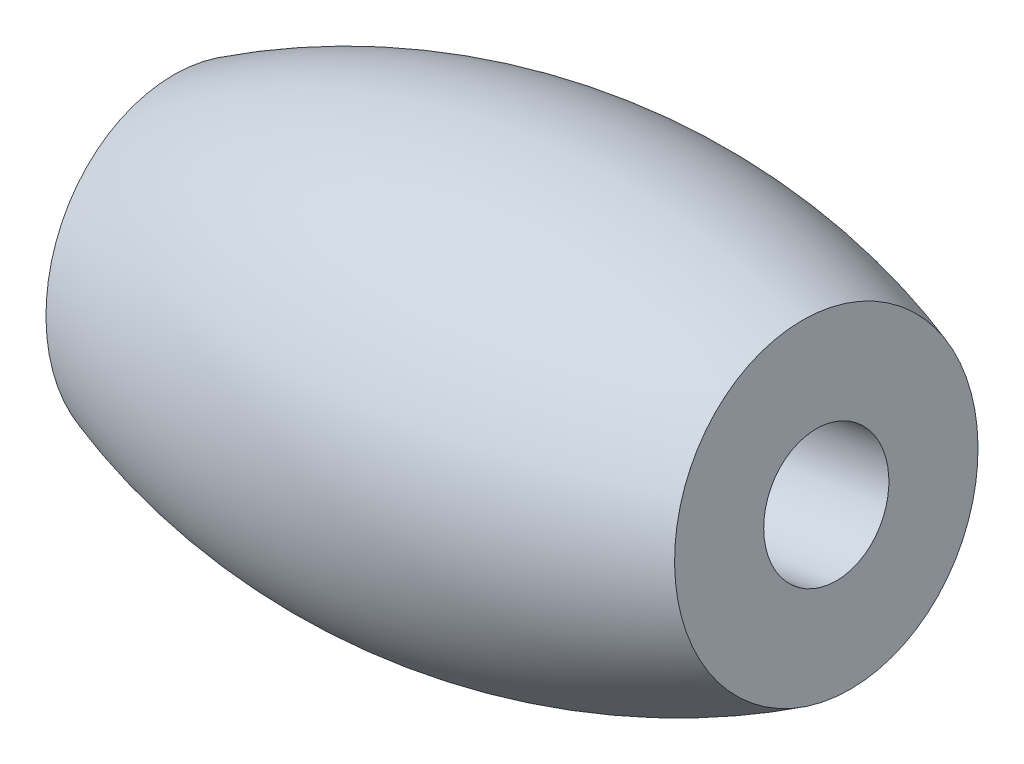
ISO-10303-21;
HEADER;
FILE_DESCRIPTION(('STEP AP214'),'2;1');
FILE_NAME('part.step','',(''),(''),'','','');
FILE_SCHEMA(('AUTOMOTIVE_DESIGN { 1 0 10303 214 1 1 1 1 }'));
ENDSEC;
DATA;
#1=APPLICATION_CONTEXT('core data for automotive mechanical design processes');
#2=APPLICATION_PROTOCOL_DEFINITION('international standard','automotive_design',2000,#1);
#3=PRODUCT_CONTEXT('',#1,'mechanical');
#4=PRODUCT('Part','Part','',(#3));
#5=PRODUCT_RELATED_PRODUCT_CATEGORY('part','',(#4));
#6=PRODUCT_DEFINITION_FORMATION('','',#4);
#7=PRODUCT_DEFINITION_CONTEXT('part definition',#1,'design');
#8=PRODUCT_DEFINITION('design','',#6,#7);
#9=PRODUCT_DEFINITION_SHAPE('','',#8);
#10=(LENGTH_UNIT() NAMED_UNIT(*) SI_UNIT(.MILLI.,.METRE.));
#11=(NAMED_UNIT(*) PLANE_ANGLE_UNIT() SI_UNIT($,.RADIAN.));
#12=(NAMED_UNIT(*) SI_UNIT($,.STERADIAN.) SOLID_ANGLE_UNIT());
#13=UNCERTAINTY_MEASURE_WITH_UNIT(LENGTH_MEASURE(1.E-05),#10,'distance_accuracy_value','');
#14=(GEOMETRIC_REPRESENTATION_CONTEXT(3) GLOBAL_UNCERTAINTY_ASSIGNED_CONTEXT((#13)) GLOBAL_UNIT_ASSIGNED_CONTEXT((#10,
#11,#12)) REPRESENTATION_CONTEXT('',''));
#15=CARTESIAN_POINT('',(0.,0.,0.));
#16=DIRECTION('',(0.,0.,1.));
#17=DIRECTION('',(1.,0.,0.));
#18=AXIS2_PLACEMENT_3D('',#15,#16,#17);
#19=CARTESIAN_POINT('',(-13.0353365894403,12.2911688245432,0.));
#20=DIRECTION('',(-0.987165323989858,-0.159701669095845,0.));
#21=DIRECTION('',(0.159701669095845,-0.987165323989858,0.));
#22=AXIS2_PLACEMENT_3D('',#19,#20,#21);
#23=DEGENERATE_TOROIDAL_SURFACE('',#22,15.8572404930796,21.6,.F.);
#24=CARTESIAN_POINT('',(-21.4262418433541,10.9337046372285,0.));
#25=DIRECTION('',(-0.987165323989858,-0.159701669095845,0.));
#26=DIRECTION('',(0.159701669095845,-0.987165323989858,0.));
#27=AXIS2_PLACEMENT_3D('',#24,#25,#26);
#28=CIRCLE('',#27,4.);
#29=CARTESIAN_POINT('',(-20.7874351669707,6.98504334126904,0.));
#30=VERTEX_POINT('',#29);
#31=EDGE_CURVE('E47',#30,#30,#28,.T.);
#32=ORIENTED_EDGE('',*,*,#31,.F.);
#33=EDGE_LOOP('',(#32));
#34=FACE_BOUND('',#33,.T.);
#35=CARTESIAN_POINT('',(-4.64443133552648,13.6486330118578,0.));
#36=DIRECTION('',(-0.987165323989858,-0.159701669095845,0.));
#37=DIRECTION('',(0.159701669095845,-0.987165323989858,0.));
#38=AXIS2_PLACEMENT_3D('',#35,#36,#37);
#39=CIRCLE('',#38,4.);
#40=CARTESIAN_POINT('',(-4.0056246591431,9.69997171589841,0.));
#41=VERTEX_POINT('',#40);
#42=EDGE_CURVE('E10',#41,#41,#39,.T.);
#43=ORIENTED_EDGE('',*,*,#42,.T.);
#44=EDGE_LOOP('',(#43));
#45=FACE_BOUND('',#44,.T.);
#46=ADVANCED_FACE('F33',(#34,#45),#23,.F.);
#47=CARTESIAN_POINT('',(-4.90793908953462,15.2774557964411,0.));
#48=DIRECTION('',(-0.987165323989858,-0.159701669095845,0.));
#49=DIRECTION('',(0.159701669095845,-0.987165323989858,0.));
#50=AXIS2_PLACEMENT_3D('',#47,#48,#49);
#51=PLANE('',#50);
#52=ORIENTED_EDGE('',*,*,#42,.F.);
#53=EDGE_LOOP('',(#52));
#54=FACE_BOUND('',#53,.T.);
#55=CARTESIAN_POINT('',(-4.64443133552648,13.6486330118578,0.));
#56=DIRECTION('',(-0.987165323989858,-0.159701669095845,0.));
#57=DIRECTION('',(0.159701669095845,-0.987165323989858,0.));
#58=AXIS2_PLACEMENT_3D('',#55,#56,#57);
#59=CIRCLE('',#58,1.65);
#60=CARTESIAN_POINT('',(-4.38092358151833,12.0198102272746,0.));
#61=VERTEX_POINT('',#60);
#62=EDGE_CURVE('E39',#61,#61,#59,.T.);
#63=ORIENTED_EDGE('',*,*,#62,.T.);
#64=EDGE_LOOP('',(#63));
#65=FACE_BOUND('',#64,.T.);
#66=ADVANCED_FACE('F56',(#54,#65),#51,.F.);
#67=CARTESIAN_POINT('',(-28.353889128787,9.81296345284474,0.));
#68=DIRECTION('',(-0.987165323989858,-0.159701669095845,0.));
#69=DIRECTION('',(0.159701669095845,-0.987165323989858,0.));
#70=AXIS2_PLACEMENT_3D('',#67,#68,#69);
#71=CYLINDRICAL_SURFACE('',#70,1.65);
#72=ORIENTED_EDGE('',*,*,#62,.F.);
#73=EDGE_LOOP('',(#72));
#74=FACE_BOUND('',#73,.T.);
#75=CARTESIAN_POINT('',(-21.4262418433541,10.9337046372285,0.));
#76=DIRECTION('',(-0.987165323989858,-0.159701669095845,0.));
#77=DIRECTION('',(0.159701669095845,-0.987165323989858,0.));
#78=AXIS2_PLACEMENT_3D('',#75,#76,#77);
#79=CIRCLE('',#78,1.65);
#80=CARTESIAN_POINT('',(-21.1627340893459,9.30488185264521,0.));
#81=VERTEX_POINT('',#80);
#82=EDGE_CURVE('E43',#81,#81,#79,.T.);
#83=ORIENTED_EDGE('',*,*,#82,.T.);
#84=EDGE_LOOP('',(#83));
#85=FACE_BOUND('',#84,.T.);
#86=ADVANCED_FACE('F60',(#74,#85),#71,.F.);
#87=CARTESIAN_POINT('',(-21.6897495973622,12.5625274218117,0.));
#88=DIRECTION('',(0.987165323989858,0.159701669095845,0.));
#89=DIRECTION('',(-0.159701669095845,0.987165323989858,0.));
#90=AXIS2_PLACEMENT_3D('',#87,#88,#89);
#91=PLANE('',#90);
#92=ORIENTED_EDGE('',*,*,#82,.F.);
#93=EDGE_LOOP('',(#92));
#94=FACE_BOUND('',#93,.T.);
#95=ORIENTED_EDGE('',*,*,#31,.T.);
#96=EDGE_LOOP('',(#95));
#97=FACE_BOUND('',#96,.T.);
#98=ADVANCED_FACE('F53',(#94,#97),#91,.F.);
#99=CLOSED_SHELL('',(#46,#66,#86,#98));
#100=MANIFOLD_SOLID_BREP('B2',#99);
#101=ADVANCED_BREP_SHAPE_REPRESENTATION('',(#18,#100),#14);
#102=SHAPE_DEFINITION_REPRESENTATION(#9,#101);
ENDSEC;
END-ISO-10303-21;
